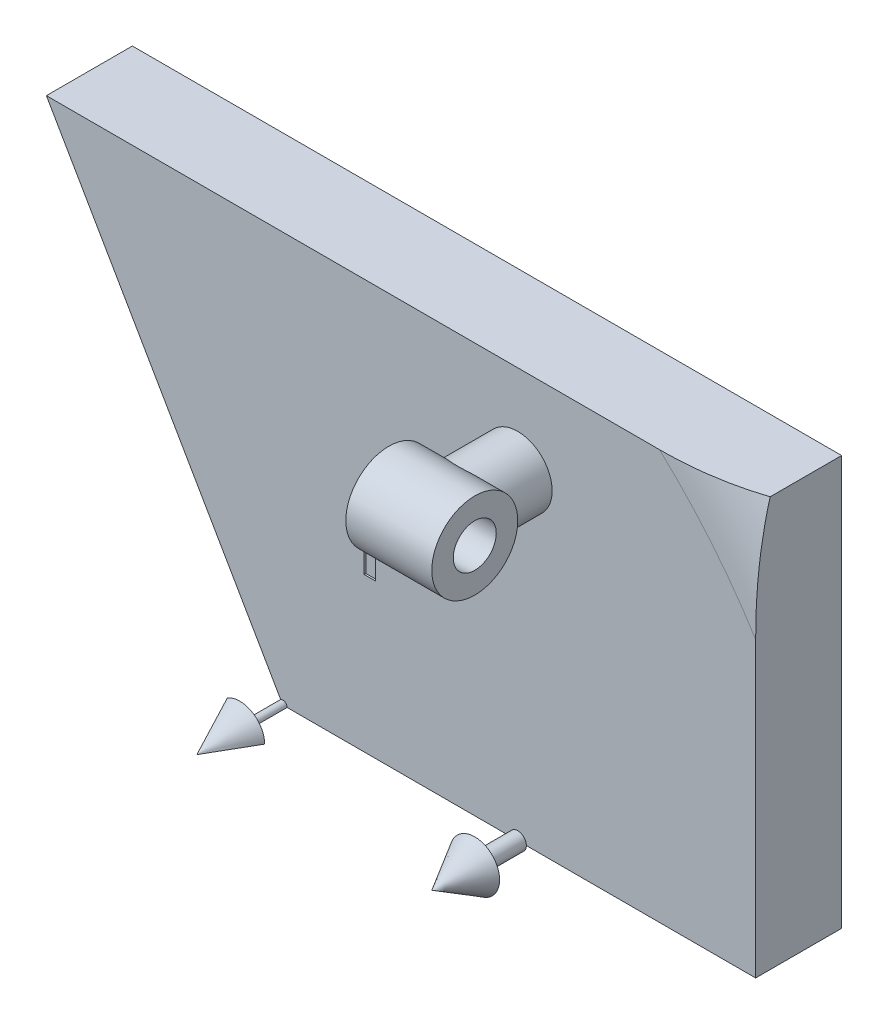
from build123d import *

# Parameters (mm, degrees)
BOSS_EXTRU_1_DEPTH      = 10
ESQUISSE3_R             = 5
ESQUISSE3_R_2           = 2.5
BOSS_EXTRU_2_DEPTH      = 5
BOSS_EXTRU_3_REACH      = 76.288
BOSS_EXTRU_3_END_RADIUS = 5
ESQUISSE4_R             = 4
R_VOLUTION1_ANGLE       = 120
ENL_V_MAT_EXTRU_2_DEPTH = 0.2


with BuildPart() as part:
    # Esquisse1 → Boss.-Extru.1 (new body)
    with BuildSketch(Plane.XY):
        Polygon((-27.5, 47.631397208), (55, 47.631397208), (55, 0), (0, 0), align=None)
    extrude(amount=BOSS_EXTRU_1_DEPTH)



with BuildPart() as body_2:
    # Esquisse3 → Boss.-Extru.2 (new, symmetric)
    with BuildSketch(Plane(origin=(27.33, 0, 0), x_dir=(0, 0, -1), z_dir=(1, 0, 0))):
        with Locations(Location((-20, 37.23, 0), (0, 0, 90))):
            Circle(ESQUISSE3_R)
        with Locations(Location((-20, 37.23, 0), (0, 0, 90))):
            Circle(ESQUISSE3_R_2, mode=Mode.SUBTRACT)
    extrude(amount=BOSS_EXTRU_2_DEPTH, both=True)


with BuildPart() as part_1:
    add(part.part)

    add(body_2.part)  # Boss.-Extru.3 merges body 2
    # Boss.-Extru.3: up to this cylinder (the profile starts outside it)
    boss_extru_3_end = Plane(origin=(27.33, 37.23, 20), z_dir=(-1, 0, 0)) * Cylinder(BOSS_EXTRU_3_END_RADIUS, 163.576, mode=Mode.PRIVATE)
    # Esquisse4 → Boss.-Extru.3 (add, up to the surface)
    with BuildSketch(Plane.XY.offset(10), mode=Mode.PRIVATE) as boss_extru_3_sk1:
        with Locations(Location((27.33, 37.23, 0), (0, 0, 180))):
            Circle(ESQUISSE4_R)
    boss_extru_3_tool1 = extrude(boss_extru_3_sk1.sketch, amount=BOSS_EXTRU_3_REACH, mode=Mode.PRIVATE) - boss_extru_3_end
    add(boss_extru_3_tool1.solids().sort_by_distance((27.33, 37.23, 10))[0])

    # Esquisse9 → R_volution1 (revolve)
    with BuildSketch(Plane.XZ):
        Polygon((0.5, 10), (0.5, 15), (2.886751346, 15), (0, 20), (0, 10), align=None)
    revolve(axis=Axis((0, 0, 10), (0, 0, 1)), revolution_arc=R_VOLUTION1_ANGLE)

    # Esquisse10 → R_volution2 (revolve)
    with BuildSketch(Plane(origin=(27.33, 0, 0), x_dir=(0, 0, -1), z_dir=(1, 0, 0))):
        Polygon((-10, 0), (-10, 1), (-15, 1), (-15, 2.886751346), (-20, 0), align=None)
    revolve(axis=Axis((27.33, 0, 10), (0, 0, 1)))

    # Esquisse8 → Enl_v. mat.-Extru.2 (cut)
    with BuildSketch(Plane.XY.offset(10)):
        Polygon((8.738321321, 25.286766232), (10.79371829, 25.286766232), (10.79371829, 17.878432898), (9.464017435, 17.878432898), (9.464017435, 24.052044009), (7.944359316, 24.052044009), align=None)
    extrude(amount=-ENL_V_MAT_EXTRU_2_DEPTH, mode=Mode.SUBTRACT)

    # Esquisse13 → Enl_vement de mati_re-R_volution1 (revolve, cut)
    with BuildSketch(Plane(origin=(0, 0, 0), x_dir=(0.866025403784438, 0.500000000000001, 0), z_dir=(0.500000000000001, -0.866025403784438, 0))):
        with BuildLine():
            Line((64.715728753, 10), (64.715728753, 14.58454929))
            Line((64.715728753, 14.58454929), (78.857864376, 14.58454929))
            Line((78.857864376, 14.58454929), (78.857864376, 4.142135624))
            ThreePointArc((78.857864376, 4.142135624), (72.3693974, 8.47759065), (64.715728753, 10))
        make_face()
    revolve(axis=Axis((0, 0, 0), (0, 0, 1)), mode=Mode.SUBTRACT)


solid = part_1.part
